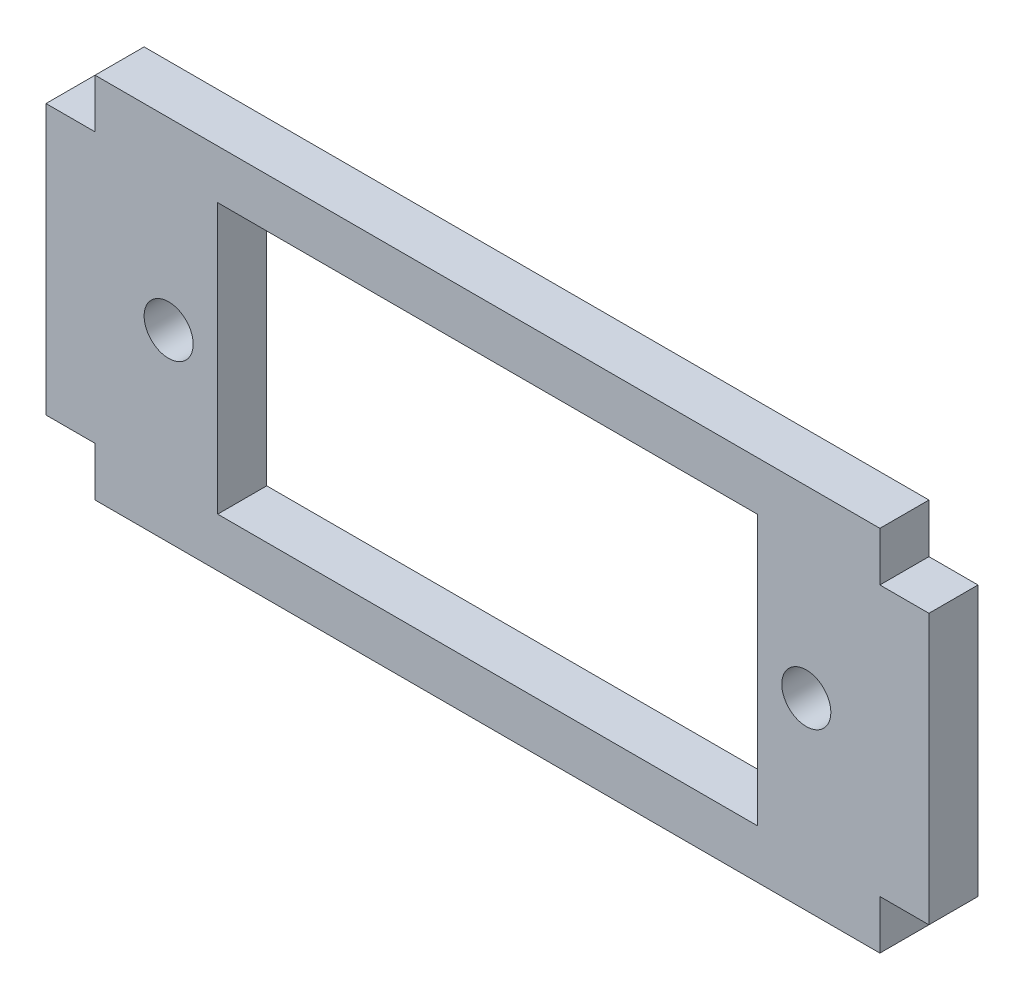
ISO-10303-21;
HEADER;
FILE_DESCRIPTION(('STEP AP214'),'2;1');
FILE_NAME('part.step','',(''),(''),'','','');
FILE_SCHEMA(('AUTOMOTIVE_DESIGN { 1 0 10303 214 1 1 1 1 }'));
ENDSEC;
DATA;
#1=APPLICATION_CONTEXT('core data for automotive mechanical design processes');
#2=APPLICATION_PROTOCOL_DEFINITION('international standard','automotive_design',2000,#1);
#3=PRODUCT_CONTEXT('',#1,'mechanical');
#4=PRODUCT('Part','Part','',(#3));
#5=PRODUCT_RELATED_PRODUCT_CATEGORY('part','',(#4));
#6=PRODUCT_DEFINITION_FORMATION('','',#4);
#7=PRODUCT_DEFINITION_CONTEXT('part definition',#1,'design');
#8=PRODUCT_DEFINITION('design','',#6,#7);
#9=PRODUCT_DEFINITION_SHAPE('','',#8);
#10=(LENGTH_UNIT() NAMED_UNIT(*) SI_UNIT(.MILLI.,.METRE.));
#11=(NAMED_UNIT(*) PLANE_ANGLE_UNIT() SI_UNIT($,.RADIAN.));
#12=(NAMED_UNIT(*) SI_UNIT($,.STERADIAN.) SOLID_ANGLE_UNIT());
#13=UNCERTAINTY_MEASURE_WITH_UNIT(LENGTH_MEASURE(1.E-05),#10,'distance_accuracy_value','');
#14=(GEOMETRIC_REPRESENTATION_CONTEXT(3) GLOBAL_UNCERTAINTY_ASSIGNED_CONTEXT((#13)) GLOBAL_UNIT_ASSIGNED_CONTEXT((#10,
#11,#12)) REPRESENTATION_CONTEXT('',''));
#15=CARTESIAN_POINT('',(0.,0.,0.));
#16=DIRECTION('',(0.,0.,1.));
#17=DIRECTION('',(1.,0.,0.));
#18=AXIS2_PLACEMENT_3D('',#15,#16,#17);
#19=CARTESIAN_POINT('',(0.,0.,2.));
#20=DIRECTION('',(0.,0.,1.));
#21=DIRECTION('',(1.,0.,0.));
#22=AXIS2_PLACEMENT_3D('',#19,#20,#21);
#23=PLANE('',#22);
#24=CARTESIAN_POINT('',(-13.,0.,2.));
#25=DIRECTION('',(0.,0.,1.));
#26=DIRECTION('',(1.,0.,0.));
#27=AXIS2_PLACEMENT_3D('',#24,#25,#26);
#28=CIRCLE('',#27,1.00000000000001);
#29=CARTESIAN_POINT('',(-12.,0.,2.));
#30=VERTEX_POINT('',#29);
#31=EDGE_CURVE('E543',#30,#30,#28,.T.);
#32=ORIENTED_EDGE('',*,*,#31,.F.);
#33=EDGE_LOOP('',(#32));
#34=FACE_BOUND('',#33,.T.);
#35=CARTESIAN_POINT('',(13.,0.,2.));
#36=DIRECTION('',(0.,0.,1.));
#37=DIRECTION('',(1.,0.,0.));
#38=AXIS2_PLACEMENT_3D('',#35,#36,#37);
#39=CIRCLE('',#38,1.00000000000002);
#40=CARTESIAN_POINT('',(14.,0.,2.));
#41=VERTEX_POINT('',#40);
#42=EDGE_CURVE('E537',#41,#41,#39,.T.);
#43=ORIENTED_EDGE('',*,*,#42,.F.);
#44=EDGE_LOOP('',(#43));
#45=FACE_BOUND('',#44,.T.);
#46=DIRECTION('',(-1.,0.,0.));
#47=VECTOR('',#46,1.);
#48=CARTESIAN_POINT('',(11.,5.5,2.));
#49=LINE('',#48,#47);
#50=CARTESIAN_POINT('',(11.,5.5,2.));
#51=VERTEX_POINT('',#50);
#52=CARTESIAN_POINT('',(-11.,5.5,2.));
#53=VERTEX_POINT('',#52);
#54=EDGE_CURVE('E227',#51,#53,#49,.T.);
#55=ORIENTED_EDGE('',*,*,#54,.F.);
#56=DIRECTION('',(0.,1.,0.));
#57=VECTOR('',#56,1.);
#58=CARTESIAN_POINT('',(11.,-5.5,2.));
#59=LINE('',#58,#57);
#60=CARTESIAN_POINT('',(11.,-5.5,2.));
#61=VERTEX_POINT('',#60);
#62=EDGE_CURVE('E225',#61,#51,#59,.T.);
#63=ORIENTED_EDGE('',*,*,#62,.F.);
#64=DIRECTION('',(1.,0.,0.));
#65=VECTOR('',#64,1.);
#66=CARTESIAN_POINT('',(11.,-5.5,2.));
#67=LINE('',#66,#65);
#68=CARTESIAN_POINT('',(-11.,-5.5,2.));
#69=VERTEX_POINT('',#68);
#70=EDGE_CURVE('E233',#69,#61,#67,.T.);
#71=ORIENTED_EDGE('',*,*,#70,.F.);
#72=DIRECTION('',(0.,-1.,0.));
#73=VECTOR('',#72,1.);
#74=CARTESIAN_POINT('',(-11.,-5.5,2.));
#75=LINE('',#74,#73);
#76=EDGE_CURVE('E230',#53,#69,#75,.T.);
#77=ORIENTED_EDGE('',*,*,#76,.F.);
#78=EDGE_LOOP('',(#55,#63,#71,#77));
#79=FACE_BOUND('',#78,.T.);
#80=DIRECTION('',(0.,1.,0.));
#81=VECTOR('',#80,1.);
#82=CARTESIAN_POINT('',(-16.,5.5,2.00000000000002));
#83=LINE('',#82,#81);
#84=CARTESIAN_POINT('',(-16.,5.5,2.00000000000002));
#85=VERTEX_POINT('',#84);
#86=CARTESIAN_POINT('',(-16.,7.5,2.));
#87=VERTEX_POINT('',#86);
#88=EDGE_CURVE('E51',#85,#87,#83,.T.);
#89=ORIENTED_EDGE('',*,*,#88,.F.);
#90=DIRECTION('',(1.,0.,0.));
#91=VECTOR('',#90,1.);
#92=CARTESIAN_POINT('',(-18.,5.5,2.00000000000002));
#93=LINE('',#92,#91);
#94=CARTESIAN_POINT('',(-18.,5.5,2.00000000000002));
#95=VERTEX_POINT('',#94);
#96=EDGE_CURVE('E530',#95,#85,#93,.T.);
#97=ORIENTED_EDGE('',*,*,#96,.F.);
#98=DIRECTION('',(0.,-1.,0.));
#99=VECTOR('',#98,1.);
#100=CARTESIAN_POINT('',(-18.,7.5,2.));
#101=LINE('',#100,#99);
#102=CARTESIAN_POINT('',(-18.,-5.5,2.));
#103=VERTEX_POINT('',#102);
#104=EDGE_CURVE('E43',#95,#103,#101,.T.);
#105=ORIENTED_EDGE('',*,*,#104,.T.);
#106=DIRECTION('',(1.,0.,0.));
#107=VECTOR('',#106,1.);
#108=CARTESIAN_POINT('',(-18.,-5.5,2.));
#109=LINE('',#108,#107);
#110=CARTESIAN_POINT('',(-16.,-5.5,2.));
#111=VERTEX_POINT('',#110);
#112=EDGE_CURVE('E514',#103,#111,#109,.T.);
#113=ORIENTED_EDGE('',*,*,#112,.T.);
#114=DIRECTION('',(0.,-1.,0.));
#115=VECTOR('',#114,1.);
#116=CARTESIAN_POINT('',(-16.,-5.5,2.));
#117=LINE('',#116,#115);
#118=CARTESIAN_POINT('',(-16.,-7.5,2.));
#119=VERTEX_POINT('',#118);
#120=EDGE_CURVE('E508',#111,#119,#117,.T.);
#121=ORIENTED_EDGE('',*,*,#120,.T.);
#122=DIRECTION('',(1.,0.,0.));
#123=VECTOR('',#122,1.);
#124=CARTESIAN_POINT('',(-18.,-7.5,2.));
#125=LINE('',#124,#123);
#126=CARTESIAN_POINT('',(16.,-7.5,2.));
#127=VERTEX_POINT('',#126);
#128=EDGE_CURVE('E11',#119,#127,#125,.T.);
#129=ORIENTED_EDGE('',*,*,#128,.T.);
#130=DIRECTION('',(0.,-1.,0.));
#131=VECTOR('',#130,1.);
#132=CARTESIAN_POINT('',(16.,-5.5,2.));
#133=LINE('',#132,#131);
#134=CARTESIAN_POINT('',(16.,-5.5,2.));
#135=VERTEX_POINT('',#134);
#136=EDGE_CURVE('E210',#135,#127,#133,.T.);
#137=ORIENTED_EDGE('',*,*,#136,.F.);
#138=DIRECTION('',(-1.,0.,0.));
#139=VECTOR('',#138,1.);
#140=CARTESIAN_POINT('',(18.,-5.5,2.));
#141=LINE('',#140,#139);
#142=CARTESIAN_POINT('',(18.,-5.5,2.));
#143=VERTEX_POINT('',#142);
#144=EDGE_CURVE('E208',#143,#135,#141,.T.);
#145=ORIENTED_EDGE('',*,*,#144,.F.);
#146=DIRECTION('',(0.,1.,0.));
#147=VECTOR('',#146,1.);
#148=CARTESIAN_POINT('',(18.,7.5,2.));
#149=LINE('',#148,#147);
#150=CARTESIAN_POINT('',(18.,5.5,2.00000000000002));
#151=VERTEX_POINT('',#150);
#152=EDGE_CURVE('E169',#143,#151,#149,.T.);
#153=ORIENTED_EDGE('',*,*,#152,.T.);
#154=DIRECTION('',(-1.,0.,0.));
#155=VECTOR('',#154,1.);
#156=CARTESIAN_POINT('',(18.,5.5,2.00000000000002));
#157=LINE('',#156,#155);
#158=CARTESIAN_POINT('',(16.,5.5,2.00000000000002));
#159=VERTEX_POINT('',#158);
#160=EDGE_CURVE('E165',#151,#159,#157,.T.);
#161=ORIENTED_EDGE('',*,*,#160,.T.);
#162=DIRECTION('',(0.,1.,0.));
#163=VECTOR('',#162,1.);
#164=CARTESIAN_POINT('',(16.,5.5,2.00000000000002));
#165=LINE('',#164,#163);
#166=CARTESIAN_POINT('',(16.,7.49999999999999,2.00000000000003));
#167=VERTEX_POINT('',#166);
#168=EDGE_CURVE('E152',#159,#167,#165,.T.);
#169=ORIENTED_EDGE('',*,*,#168,.T.);
#170=DIRECTION('',(-1.,0.,0.));
#171=VECTOR('',#170,1.);
#172=CARTESIAN_POINT('',(-18.,7.5,2.));
#173=LINE('',#172,#171);
#174=EDGE_CURVE('E163',#167,#87,#173,.T.);
#175=ORIENTED_EDGE('',*,*,#174,.T.);
#176=EDGE_LOOP('',(#89,#97,#105,#113,#121,#129,#137,#145,#153,#161,#169,#175));
#177=FACE_BOUND('',#176,.T.);
#178=ADVANCED_FACE('F34',(#34,#45,#79,#177),#23,.T.);
#179=CARTESIAN_POINT('',(0.,0.,0.));
#180=DIRECTION('',(0.,0.,1.));
#181=DIRECTION('',(1.,0.,0.));
#182=AXIS2_PLACEMENT_3D('',#179,#180,#181);
#183=PLANE('',#182);
#184=CARTESIAN_POINT('',(-13.,0.,0.));
#185=DIRECTION('',(0.,0.,1.));
#186=DIRECTION('',(1.,0.,0.));
#187=AXIS2_PLACEMENT_3D('',#184,#185,#186);
#188=CIRCLE('',#187,1.00000000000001);
#189=CARTESIAN_POINT('',(-12.,0.,0.));
#190=VERTEX_POINT('',#189);
#191=EDGE_CURVE('E535',#190,#190,#188,.T.);
#192=ORIENTED_EDGE('',*,*,#191,.T.);
#193=EDGE_LOOP('',(#192));
#194=FACE_BOUND('',#193,.T.);
#195=CARTESIAN_POINT('',(13.,0.,0.));
#196=DIRECTION('',(0.,0.,1.));
#197=DIRECTION('',(1.,0.,0.));
#198=AXIS2_PLACEMENT_3D('',#195,#196,#197);
#199=CIRCLE('',#198,1.00000000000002);
#200=CARTESIAN_POINT('',(14.,0.,0.));
#201=VERTEX_POINT('',#200);
#202=EDGE_CURVE('E540',#201,#201,#199,.T.);
#203=ORIENTED_EDGE('',*,*,#202,.T.);
#204=EDGE_LOOP('',(#203));
#205=FACE_BOUND('',#204,.T.);
#206=DIRECTION('',(0.,1.,0.));
#207=VECTOR('',#206,1.);
#208=CARTESIAN_POINT('',(11.,-5.5,0.));
#209=LINE('',#208,#207);
#210=CARTESIAN_POINT('',(11.,-5.5,0.));
#211=VERTEX_POINT('',#210);
#212=CARTESIAN_POINT('',(11.,5.5,0.));
#213=VERTEX_POINT('',#212);
#214=EDGE_CURVE('E236',#211,#213,#209,.T.);
#215=ORIENTED_EDGE('',*,*,#214,.T.);
#216=DIRECTION('',(-1.,0.,0.));
#217=VECTOR('',#216,1.);
#218=CARTESIAN_POINT('',(11.,5.5,0.));
#219=LINE('',#218,#217);
#220=CARTESIAN_POINT('',(-11.,5.5,0.));
#221=VERTEX_POINT('',#220);
#222=EDGE_CURVE('E239',#213,#221,#219,.T.);
#223=ORIENTED_EDGE('',*,*,#222,.T.);
#224=DIRECTION('',(0.,-1.,0.));
#225=VECTOR('',#224,1.);
#226=CARTESIAN_POINT('',(-11.,-5.5,0.));
#227=LINE('',#226,#225);
#228=CARTESIAN_POINT('',(-11.,-5.5,0.));
#229=VERTEX_POINT('',#228);
#230=EDGE_CURVE('E242',#221,#229,#227,.T.);
#231=ORIENTED_EDGE('',*,*,#230,.T.);
#232=DIRECTION('',(1.,0.,0.));
#233=VECTOR('',#232,1.);
#234=CARTESIAN_POINT('',(11.,-5.5,0.));
#235=LINE('',#234,#233);
#236=EDGE_CURVE('E228',#229,#211,#235,.T.);
#237=ORIENTED_EDGE('',*,*,#236,.T.);
#238=EDGE_LOOP('',(#215,#223,#231,#237));
#239=FACE_BOUND('',#238,.T.);
#240=DIRECTION('',(0.,1.,0.));
#241=VECTOR('',#240,1.);
#242=CARTESIAN_POINT('',(16.,5.5,0.));
#243=LINE('',#242,#241);
#244=CARTESIAN_POINT('',(16.,5.5,0.));
#245=VERTEX_POINT('',#244);
#246=CARTESIAN_POINT('',(16.,7.5,0.));
#247=VERTEX_POINT('',#246);
#248=EDGE_CURVE('E59',#245,#247,#243,.T.);
#249=ORIENTED_EDGE('',*,*,#248,.F.);
#250=DIRECTION('',(-1.,0.,0.));
#251=VECTOR('',#250,1.);
#252=CARTESIAN_POINT('',(0.,5.5,0.));
#253=LINE('',#252,#251);
#254=CARTESIAN_POINT('',(18.,5.5,0.));
#255=VERTEX_POINT('',#254);
#256=EDGE_CURVE('E506',#255,#245,#253,.T.);
#257=ORIENTED_EDGE('',*,*,#256,.F.);
#258=DIRECTION('',(0.,1.,0.));
#259=VECTOR('',#258,1.);
#260=CARTESIAN_POINT('',(18.,7.5,0.));
#261=LINE('',#260,#259);
#262=CARTESIAN_POINT('',(18.,-5.5,0.));
#263=VERTEX_POINT('',#262);
#264=EDGE_CURVE('E175',#263,#255,#261,.T.);
#265=ORIENTED_EDGE('',*,*,#264,.F.);
#266=DIRECTION('',(1.,0.,0.));
#267=VECTOR('',#266,1.);
#268=CARTESIAN_POINT('',(0.,-5.5,0.));
#269=LINE('',#268,#267);
#270=CARTESIAN_POINT('',(16.,-5.5,0.));
#271=VERTEX_POINT('',#270);
#272=EDGE_CURVE('E204',#271,#263,#269,.T.);
#273=ORIENTED_EDGE('',*,*,#272,.F.);
#274=DIRECTION('',(0.,-1.,0.));
#275=VECTOR('',#274,1.);
#276=CARTESIAN_POINT('',(16.,-5.5,0.));
#277=LINE('',#276,#275);
#278=CARTESIAN_POINT('',(16.,-7.5,0.));
#279=VERTEX_POINT('',#278);
#280=EDGE_CURVE('E202',#271,#279,#277,.T.);
#281=ORIENTED_EDGE('',*,*,#280,.T.);
#282=DIRECTION('',(1.,0.,0.));
#283=VECTOR('',#282,1.);
#284=CARTESIAN_POINT('',(-18.,-7.5,0.));
#285=LINE('',#284,#283);
#286=CARTESIAN_POINT('',(-16.,-7.5,0.));
#287=VERTEX_POINT('',#286);
#288=EDGE_CURVE('E38',#287,#279,#285,.T.);
#289=ORIENTED_EDGE('',*,*,#288,.F.);
#290=DIRECTION('',(0.,-1.,0.));
#291=VECTOR('',#290,1.);
#292=CARTESIAN_POINT('',(-16.,-5.5,0.));
#293=LINE('',#292,#291);
#294=CARTESIAN_POINT('',(-16.,-5.5,0.));
#295=VERTEX_POINT('',#294);
#296=EDGE_CURVE('E200',#295,#287,#293,.T.);
#297=ORIENTED_EDGE('',*,*,#296,.F.);
#298=CARTESIAN_POINT('',(-18.,-5.5,0.));
#299=VERTEX_POINT('',#298);
#300=EDGE_CURVE('E224',#299,#295,#269,.T.);
#301=ORIENTED_EDGE('',*,*,#300,.F.);
#302=DIRECTION('',(0.,-1.,0.));
#303=VECTOR('',#302,1.);
#304=CARTESIAN_POINT('',(-18.,7.5,0.));
#305=LINE('',#304,#303);
#306=CARTESIAN_POINT('',(-18.,5.5,0.));
#307=VERTEX_POINT('',#306);
#308=EDGE_CURVE('E180',#307,#299,#305,.T.);
#309=ORIENTED_EDGE('',*,*,#308,.F.);
#310=CARTESIAN_POINT('',(-16.,5.5,0.));
#311=VERTEX_POINT('',#310);
#312=EDGE_CURVE('E501',#311,#307,#253,.T.);
#313=ORIENTED_EDGE('',*,*,#312,.F.);
#314=DIRECTION('',(0.,1.,0.));
#315=VECTOR('',#314,1.);
#316=CARTESIAN_POINT('',(-16.,5.5,0.));
#317=LINE('',#316,#315);
#318=CARTESIAN_POINT('',(-16.,7.5,0.));
#319=VERTEX_POINT('',#318);
#320=EDGE_CURVE('E158',#311,#319,#317,.T.);
#321=ORIENTED_EDGE('',*,*,#320,.T.);
#322=DIRECTION('',(-1.,0.,0.));
#323=VECTOR('',#322,1.);
#324=CARTESIAN_POINT('',(-18.,7.5,0.));
#325=LINE('',#324,#323);
#326=EDGE_CURVE('E178',#247,#319,#325,.T.);
#327=ORIENTED_EDGE('',*,*,#326,.F.);
#328=EDGE_LOOP('',(#249,#257,#265,#273,#281,#289,#297,#301,#309,#313,#321,#327));
#329=FACE_BOUND('',#328,.T.);
#330=ADVANCED_FACE('F198',(#194,#205,#239,#329),#183,.F.);
#331=CARTESIAN_POINT('',(18.,7.5,2.));
#332=DIRECTION('',(-1.,0.,0.));
#333=DIRECTION('',(0.,0.,1.));
#334=AXIS2_PLACEMENT_3D('',#331,#332,#333);
#335=PLANE('',#334);
#336=DIRECTION('',(0.,0.,1.));
#337=VECTOR('',#336,1.);
#338=CARTESIAN_POINT('',(18.,5.50000000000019,-54.05551275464));
#339=LINE('',#338,#337);
#340=EDGE_CURVE('E498',#255,#151,#339,.T.);
#341=ORIENTED_EDGE('',*,*,#340,.T.);
#342=ORIENTED_EDGE('',*,*,#152,.F.);
#343=DIRECTION('',(0.,0.,1.));
#344=VECTOR('',#343,1.);
#345=CARTESIAN_POINT('',(18.,-5.5,-54.05551275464));
#346=LINE('',#345,#344);
#347=EDGE_CURVE('E219',#263,#143,#346,.T.);
#348=ORIENTED_EDGE('',*,*,#347,.F.);
#349=ORIENTED_EDGE('',*,*,#264,.T.);
#350=EDGE_LOOP('',(#341,#342,#348,#349));
#351=FACE_BOUND('',#350,.T.);
#352=ADVANCED_FACE('F36',(#351),#335,.F.);
#353=CARTESIAN_POINT('',(-18.,7.5,2.));
#354=DIRECTION('',(1.,0.,0.));
#355=DIRECTION('',(0.,0.,-1.));
#356=AXIS2_PLACEMENT_3D('',#353,#354,#355);
#357=PLANE('',#356);
#358=DIRECTION('',(0.,0.,1.));
#359=VECTOR('',#358,1.);
#360=CARTESIAN_POINT('',(-18.,5.50000000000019,-54.05551275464));
#361=LINE('',#360,#359);
#362=EDGE_CURVE('E502',#307,#95,#361,.T.);
#363=ORIENTED_EDGE('',*,*,#362,.F.);
#364=ORIENTED_EDGE('',*,*,#308,.T.);
#365=DIRECTION('',(0.,0.,1.));
#366=VECTOR('',#365,1.);
#367=CARTESIAN_POINT('',(-18.,-5.5,-54.05551275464));
#368=LINE('',#367,#366);
#369=EDGE_CURVE('E221',#299,#103,#368,.T.);
#370=ORIENTED_EDGE('',*,*,#369,.T.);
#371=ORIENTED_EDGE('',*,*,#104,.F.);
#372=EDGE_LOOP('',(#363,#364,#370,#371));
#373=FACE_BOUND('',#372,.T.);
#374=ADVANCED_FACE('F295',(#373),#357,.F.);
#375=CARTESIAN_POINT('',(-18.,7.5,2.));
#376=DIRECTION('',(0.,-1.,0.));
#377=DIRECTION('',(0.,0.,-1.));
#378=AXIS2_PLACEMENT_3D('',#375,#376,#377);
#379=PLANE('',#378);
#380=DIRECTION('',(0.,0.,-1.));
#381=VECTOR('',#380,1.);
#382=CARTESIAN_POINT('',(-16.,7.49999999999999,2.00000000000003));
#383=LINE('',#382,#381);
#384=EDGE_CURVE('E168',#87,#319,#383,.T.);
#385=ORIENTED_EDGE('',*,*,#384,.F.);
#386=ORIENTED_EDGE('',*,*,#174,.F.);
#387=DIRECTION('',(0.,0.,-1.));
#388=VECTOR('',#387,1.);
#389=CARTESIAN_POINT('',(16.,7.49999999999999,2.00000000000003));
#390=LINE('',#389,#388);
#391=EDGE_CURVE('E149',#167,#247,#390,.T.);
#392=ORIENTED_EDGE('',*,*,#391,.T.);
#393=ORIENTED_EDGE('',*,*,#326,.T.);
#394=EDGE_LOOP('',(#385,#386,#392,#393));
#395=FACE_BOUND('',#394,.T.);
#396=ADVANCED_FACE('F167',(#395),#379,.F.);
#397=CARTESIAN_POINT('',(-18.,-7.5,2.));
#398=DIRECTION('',(0.,1.,0.));
#399=DIRECTION('',(0.,0.,1.));
#400=AXIS2_PLACEMENT_3D('',#397,#398,#399);
#401=PLANE('',#400);
#402=DIRECTION('',(0.,0.,-1.));
#403=VECTOR('',#402,1.);
#404=CARTESIAN_POINT('',(16.,-7.5,2.));
#405=LINE('',#404,#403);
#406=EDGE_CURVE('E193',#127,#279,#405,.T.);
#407=ORIENTED_EDGE('',*,*,#406,.F.);
#408=ORIENTED_EDGE('',*,*,#128,.F.);
#409=DIRECTION('',(0.,0.,-1.));
#410=VECTOR('',#409,1.);
#411=CARTESIAN_POINT('',(-16.,-7.5,2.));
#412=LINE('',#411,#410);
#413=EDGE_CURVE('E194',#119,#287,#412,.T.);
#414=ORIENTED_EDGE('',*,*,#413,.T.);
#415=ORIENTED_EDGE('',*,*,#288,.T.);
#416=EDGE_LOOP('',(#407,#408,#414,#415));
#417=FACE_BOUND('',#416,.T.);
#418=ADVANCED_FACE('F191',(#417),#401,.F.);
#419=CARTESIAN_POINT('',(11.,-5.5,2.));
#420=DIRECTION('',(-1.,0.,0.));
#421=DIRECTION('',(0.,0.,1.));
#422=AXIS2_PLACEMENT_3D('',#419,#420,#421);
#423=PLANE('',#422);
#424=ORIENTED_EDGE('',*,*,#214,.F.);
#425=DIRECTION('',(0.,0.,-1.));
#426=VECTOR('',#425,1.);
#427=CARTESIAN_POINT('',(11.,-5.5,2.));
#428=LINE('',#427,#426);
#429=EDGE_CURVE('E235',#61,#211,#428,.T.);
#430=ORIENTED_EDGE('',*,*,#429,.F.);
#431=ORIENTED_EDGE('',*,*,#62,.T.);
#432=DIRECTION('',(0.,0.,-1.));
#433=VECTOR('',#432,1.);
#434=CARTESIAN_POINT('',(11.,5.5,2.));
#435=LINE('',#434,#433);
#436=EDGE_CURVE('E179',#51,#213,#435,.T.);
#437=ORIENTED_EDGE('',*,*,#436,.T.);
#438=EDGE_LOOP('',(#424,#430,#431,#437));
#439=FACE_BOUND('',#438,.T.);
#440=ADVANCED_FACE('F255',(#439),#423,.T.);
#441=CARTESIAN_POINT('',(11.,5.5,2.));
#442=DIRECTION('',(0.,-1.,0.));
#443=DIRECTION('',(0.,0.,-1.));
#444=AXIS2_PLACEMENT_3D('',#441,#442,#443);
#445=PLANE('',#444);
#446=ORIENTED_EDGE('',*,*,#222,.F.);
#447=ORIENTED_EDGE('',*,*,#436,.F.);
#448=ORIENTED_EDGE('',*,*,#54,.T.);
#449=DIRECTION('',(0.,0.,-1.));
#450=VECTOR('',#449,1.);
#451=CARTESIAN_POINT('',(-11.,5.5,2.));
#452=LINE('',#451,#450);
#453=EDGE_CURVE('E251',#53,#221,#452,.T.);
#454=ORIENTED_EDGE('',*,*,#453,.T.);
#455=EDGE_LOOP('',(#446,#447,#448,#454));
#456=FACE_BOUND('',#455,.T.);
#457=ADVANCED_FACE('F269',(#456),#445,.T.);
#458=CARTESIAN_POINT('',(-11.,-5.5,2.));
#459=DIRECTION('',(1.,0.,0.));
#460=DIRECTION('',(0.,0.,-1.));
#461=AXIS2_PLACEMENT_3D('',#458,#459,#460);
#462=PLANE('',#461);
#463=ORIENTED_EDGE('',*,*,#230,.F.);
#464=ORIENTED_EDGE('',*,*,#453,.F.);
#465=ORIENTED_EDGE('',*,*,#76,.T.);
#466=DIRECTION('',(0.,0.,-1.));
#467=VECTOR('',#466,1.);
#468=CARTESIAN_POINT('',(-11.,-5.5,2.));
#469=LINE('',#468,#467);
#470=EDGE_CURVE('E249',#69,#229,#469,.T.);
#471=ORIENTED_EDGE('',*,*,#470,.T.);
#472=EDGE_LOOP('',(#463,#464,#465,#471));
#473=FACE_BOUND('',#472,.T.);
#474=ADVANCED_FACE('F271',(#473),#462,.T.);
#475=CARTESIAN_POINT('',(11.,-5.5,2.));
#476=DIRECTION('',(0.,1.,0.));
#477=DIRECTION('',(0.,0.,1.));
#478=AXIS2_PLACEMENT_3D('',#475,#476,#477);
#479=PLANE('',#478);
#480=ORIENTED_EDGE('',*,*,#236,.F.);
#481=ORIENTED_EDGE('',*,*,#470,.F.);
#482=ORIENTED_EDGE('',*,*,#70,.T.);
#483=ORIENTED_EDGE('',*,*,#429,.T.);
#484=EDGE_LOOP('',(#480,#481,#482,#483));
#485=FACE_BOUND('',#484,.T.);
#486=ADVANCED_FACE('F264',(#485),#479,.T.);
#487=CARTESIAN_POINT('',(-16.,-5.5,2.));
#488=DIRECTION('',(1.,0.,0.));
#489=DIRECTION('',(0.,0.,-1.));
#490=AXIS2_PLACEMENT_3D('',#487,#488,#489);
#491=PLANE('',#490);
#492=ORIENTED_EDGE('',*,*,#296,.T.);
#493=ORIENTED_EDGE('',*,*,#413,.F.);
#494=ORIENTED_EDGE('',*,*,#120,.F.);
#495=DIRECTION('',(0.,0.,-1.));
#496=VECTOR('',#495,1.);
#497=CARTESIAN_POINT('',(-16.,-5.5,2.));
#498=LINE('',#497,#496);
#499=EDGE_CURVE('E212',#111,#295,#498,.T.);
#500=ORIENTED_EDGE('',*,*,#499,.T.);
#501=EDGE_LOOP('',(#492,#493,#494,#500));
#502=FACE_BOUND('',#501,.T.);
#503=ADVANCED_FACE('F278',(#502),#491,.F.);
#504=CARTESIAN_POINT('',(-18.,-5.5,-54.05551275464));
#505=DIRECTION('',(0.,-1.,0.));
#506=DIRECTION('',(-1.,0.,0.));
#507=AXIS2_PLACEMENT_3D('',#504,#505,#506);
#508=PLANE('',#507);
#509=ORIENTED_EDGE('',*,*,#300,.T.);
#510=ORIENTED_EDGE('',*,*,#499,.F.);
#511=ORIENTED_EDGE('',*,*,#112,.F.);
#512=ORIENTED_EDGE('',*,*,#369,.F.);
#513=EDGE_LOOP('',(#509,#510,#511,#512));
#514=FACE_BOUND('',#513,.T.);
#515=ADVANCED_FACE('F335',(#514),#508,.T.);
#516=ORIENTED_EDGE('',*,*,#272,.T.);
#517=ORIENTED_EDGE('',*,*,#347,.T.);
#518=ORIENTED_EDGE('',*,*,#144,.T.);
#519=DIRECTION('',(0.,0.,-1.));
#520=VECTOR('',#519,1.);
#521=CARTESIAN_POINT('',(16.,-5.5,2.));
#522=LINE('',#521,#520);
#523=EDGE_CURVE('E217',#135,#271,#522,.T.);
#524=ORIENTED_EDGE('',*,*,#523,.T.);
#525=EDGE_LOOP('',(#516,#517,#518,#524));
#526=FACE_BOUND('',#525,.T.);
#527=ADVANCED_FACE('F343',(#526),#508,.T.);
#528=CARTESIAN_POINT('',(16.,-5.5,2.));
#529=DIRECTION('',(1.,0.,0.));
#530=DIRECTION('',(0.,0.,-1.));
#531=AXIS2_PLACEMENT_3D('',#528,#529,#530);
#532=PLANE('',#531);
#533=ORIENTED_EDGE('',*,*,#280,.F.);
#534=ORIENTED_EDGE('',*,*,#523,.F.);
#535=ORIENTED_EDGE('',*,*,#136,.T.);
#536=ORIENTED_EDGE('',*,*,#406,.T.);
#537=EDGE_LOOP('',(#533,#534,#535,#536));
#538=FACE_BOUND('',#537,.T.);
#539=ADVANCED_FACE('F351',(#538),#532,.T.);
#540=CARTESIAN_POINT('',(16.,5.5,2.00000000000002));
#541=DIRECTION('',(-1.,0.,0.));
#542=DIRECTION('',(0.,0.,-1.));
#543=AXIS2_PLACEMENT_3D('',#540,#541,#542);
#544=PLANE('',#543);
#545=ORIENTED_EDGE('',*,*,#248,.T.);
#546=ORIENTED_EDGE('',*,*,#391,.F.);
#547=ORIENTED_EDGE('',*,*,#168,.F.);
#548=DIRECTION('',(0.,0.,-1.));
#549=VECTOR('',#548,1.);
#550=CARTESIAN_POINT('',(16.,5.5,2.00000000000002));
#551=LINE('',#550,#549);
#552=EDGE_CURVE('E159',#159,#245,#551,.T.);
#553=ORIENTED_EDGE('',*,*,#552,.T.);
#554=EDGE_LOOP('',(#545,#546,#547,#553));
#555=FACE_BOUND('',#554,.T.);
#556=ADVANCED_FACE('F151',(#555),#544,.F.);
#557=CARTESIAN_POINT('',(18.,5.50000000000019,-54.05551275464));
#558=DIRECTION('',(0.,1.,0.));
#559=DIRECTION('',(1.,0.,0.));
#560=AXIS2_PLACEMENT_3D('',#557,#558,#559);
#561=PLANE('',#560);
#562=ORIENTED_EDGE('',*,*,#256,.T.);
#563=ORIENTED_EDGE('',*,*,#552,.F.);
#564=ORIENTED_EDGE('',*,*,#160,.F.);
#565=ORIENTED_EDGE('',*,*,#340,.F.);
#566=EDGE_LOOP('',(#562,#563,#564,#565));
#567=FACE_BOUND('',#566,.T.);
#568=ADVANCED_FACE('F364',(#567),#561,.T.);
#569=ORIENTED_EDGE('',*,*,#312,.T.);
#570=ORIENTED_EDGE('',*,*,#362,.T.);
#571=ORIENTED_EDGE('',*,*,#96,.T.);
#572=DIRECTION('',(0.,0.,-1.));
#573=VECTOR('',#572,1.);
#574=CARTESIAN_POINT('',(-16.,5.5,2.00000000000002));
#575=LINE('',#574,#573);
#576=EDGE_CURVE('E524',#85,#311,#575,.T.);
#577=ORIENTED_EDGE('',*,*,#576,.T.);
#578=EDGE_LOOP('',(#569,#570,#571,#577));
#579=FACE_BOUND('',#578,.T.);
#580=ADVANCED_FACE('F371',(#579),#561,.T.);
#581=CARTESIAN_POINT('',(-16.,5.5,2.00000000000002));
#582=DIRECTION('',(-1.,0.,0.));
#583=DIRECTION('',(0.,0.,-1.));
#584=AXIS2_PLACEMENT_3D('',#581,#582,#583);
#585=PLANE('',#584);
#586=ORIENTED_EDGE('',*,*,#320,.F.);
#587=ORIENTED_EDGE('',*,*,#576,.F.);
#588=ORIENTED_EDGE('',*,*,#88,.T.);
#589=ORIENTED_EDGE('',*,*,#384,.T.);
#590=EDGE_LOOP('',(#586,#587,#588,#589));
#591=FACE_BOUND('',#590,.T.);
#592=ADVANCED_FACE('F379',(#591),#585,.T.);
#593=CARTESIAN_POINT('',(13.,0.,0.));
#594=DIRECTION('',(0.,0.,1.));
#595=DIRECTION('',(1.,0.,0.));
#596=AXIS2_PLACEMENT_3D('',#593,#594,#595);
#597=CYLINDRICAL_SURFACE('',#596,1.00000000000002);
#598=ORIENTED_EDGE('',*,*,#202,.F.);
#599=EDGE_LOOP('',(#598));
#600=FACE_BOUND('',#599,.T.);
#601=ORIENTED_EDGE('',*,*,#42,.T.);
#602=EDGE_LOOP('',(#601));
#603=FACE_BOUND('',#602,.T.);
#604=ADVANCED_FACE('F386',(#600,#603),#597,.F.);
#605=CARTESIAN_POINT('',(-13.,0.,0.));
#606=DIRECTION('',(0.,0.,1.));
#607=DIRECTION('',(1.,0.,0.));
#608=AXIS2_PLACEMENT_3D('',#605,#606,#607);
#609=CYLINDRICAL_SURFACE('',#608,1.00000000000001);
#610=ORIENTED_EDGE('',*,*,#191,.F.);
#611=EDGE_LOOP('',(#610));
#612=FACE_BOUND('',#611,.T.);
#613=ORIENTED_EDGE('',*,*,#31,.T.);
#614=EDGE_LOOP('',(#613));
#615=FACE_BOUND('',#614,.T.);
#616=ADVANCED_FACE('F393',(#612,#615),#609,.F.);
#617=CLOSED_SHELL('',(#178,#330,#352,#374,#396,#418,#440,#457,#474,#486,#503,#515,#527,#539,
#556,#568,#580,#592,#604,#616));
#618=MANIFOLD_SOLID_BREP('B2',#617);
#619=ADVANCED_BREP_SHAPE_REPRESENTATION('',(#18,#618),#14);
#620=SHAPE_DEFINITION_REPRESENTATION(#9,#619);
ENDSEC;
END-ISO-10303-21;
